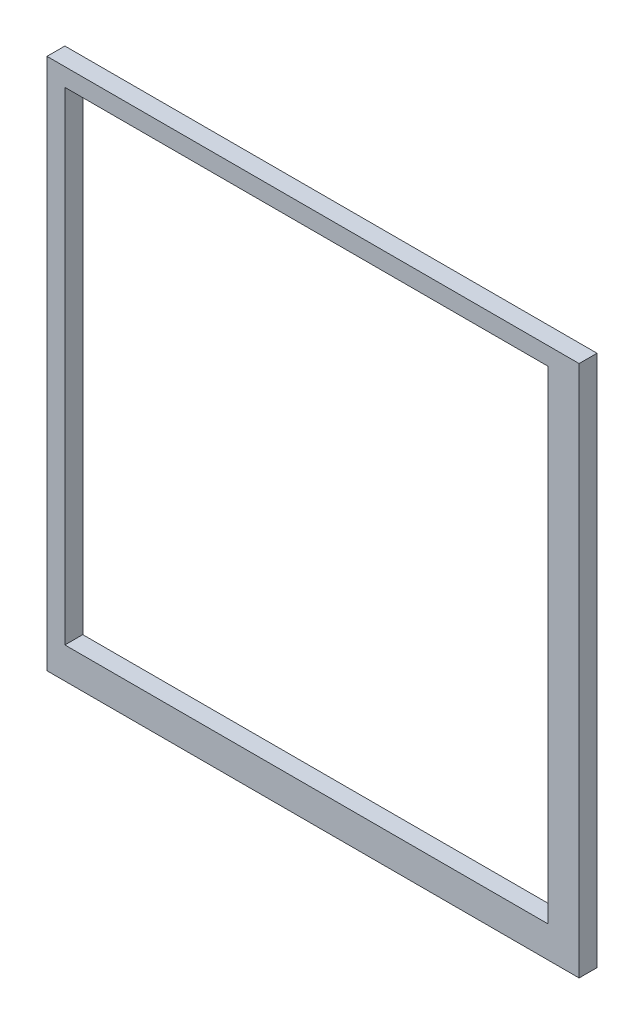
ISO-10303-21;
HEADER;
FILE_DESCRIPTION(('STEP AP214'),'2;1');
FILE_NAME('part.step','',(''),(''),'','','');
FILE_SCHEMA(('AUTOMOTIVE_DESIGN { 1 0 10303 214 1 1 1 1 }'));
ENDSEC;
DATA;
#1=APPLICATION_CONTEXT('core data for automotive mechanical design processes');
#2=APPLICATION_PROTOCOL_DEFINITION('international standard','automotive_design',2000,#1);
#3=PRODUCT_CONTEXT('',#1,'mechanical');
#4=PRODUCT('Part','Part','',(#3));
#5=PRODUCT_RELATED_PRODUCT_CATEGORY('part','',(#4));
#6=PRODUCT_DEFINITION_FORMATION('','',#4);
#7=PRODUCT_DEFINITION_CONTEXT('part definition',#1,'design');
#8=PRODUCT_DEFINITION('design','',#6,#7);
#9=PRODUCT_DEFINITION_SHAPE('','',#8);
#10=(LENGTH_UNIT() NAMED_UNIT(*) SI_UNIT(.MILLI.,.METRE.));
#11=(NAMED_UNIT(*) PLANE_ANGLE_UNIT() SI_UNIT($,.RADIAN.));
#12=(NAMED_UNIT(*) SI_UNIT($,.STERADIAN.) SOLID_ANGLE_UNIT());
#13=UNCERTAINTY_MEASURE_WITH_UNIT(LENGTH_MEASURE(1.E-05),#10,'distance_accuracy_value','');
#14=(GEOMETRIC_REPRESENTATION_CONTEXT(3) GLOBAL_UNCERTAINTY_ASSIGNED_CONTEXT((#13)) GLOBAL_UNIT_ASSIGNED_CONTEXT((#10,
#11,#12)) REPRESENTATION_CONTEXT('',''));
#15=CARTESIAN_POINT('',(0.,0.,0.));
#16=DIRECTION('',(0.,0.,1.));
#17=DIRECTION('',(1.,0.,0.));
#18=AXIS2_PLACEMENT_3D('',#15,#16,#17);
#19=CARTESIAN_POINT('',(0.,0.,20.));
#20=DIRECTION('',(0.,0.,-1.));
#21=DIRECTION('',(-1.,0.,0.));
#22=AXIS2_PLACEMENT_3D('',#19,#20,#21);
#23=PLANE('',#22);
#24=DIRECTION('',(-1.,0.,0.));
#25=VECTOR('',#24,1.);
#26=CARTESIAN_POINT('',(-290.,290.,20.));
#27=LINE('',#26,#25);
#28=CARTESIAN_POINT('',(305.,290.,20.));
#29=VERTEX_POINT('',#28);
#30=CARTESIAN_POINT('',(-290.,290.,20.));
#31=VERTEX_POINT('',#30);
#32=EDGE_CURVE('E135',#29,#31,#27,.T.);
#33=ORIENTED_EDGE('',*,*,#32,.T.);
#34=DIRECTION('',(0.,-1.,0.));
#35=VECTOR('',#34,1.);
#36=CARTESIAN_POINT('',(-290.,290.,20.));
#37=LINE('',#36,#35);
#38=CARTESIAN_POINT('',(-290.,-305.,20.));
#39=VERTEX_POINT('',#38);
#40=EDGE_CURVE('E138',#31,#39,#37,.T.);
#41=ORIENTED_EDGE('',*,*,#40,.T.);
#42=DIRECTION('',(1.,0.,0.));
#43=VECTOR('',#42,1.);
#44=CARTESIAN_POINT('',(-290.,-305.,20.));
#45=LINE('',#44,#43);
#46=CARTESIAN_POINT('',(305.,-305.,20.));
#47=VERTEX_POINT('',#46);
#48=EDGE_CURVE('E141',#39,#47,#45,.T.);
#49=ORIENTED_EDGE('',*,*,#48,.T.);
#50=DIRECTION('',(0.,1.,0.));
#51=VECTOR('',#50,1.);
#52=CARTESIAN_POINT('',(305.,290.,20.));
#53=LINE('',#52,#51);
#54=EDGE_CURVE('E143',#47,#29,#53,.T.);
#55=ORIENTED_EDGE('',*,*,#54,.T.);
#56=EDGE_LOOP('',(#33,#41,#49,#55));
#57=FACE_BOUND('',#56,.T.);
#58=DIRECTION('',(0.,1.,0.));
#59=VECTOR('',#58,1.);
#60=CARTESIAN_POINT('',(270.,270.,20.));
#61=LINE('',#60,#59);
#62=CARTESIAN_POINT('',(270.,-270.,20.));
#63=VERTEX_POINT('',#62);
#64=CARTESIAN_POINT('',(270.,270.,20.));
#65=VERTEX_POINT('',#64);
#66=EDGE_CURVE('E99',#63,#65,#61,.T.);
#67=ORIENTED_EDGE('',*,*,#66,.F.);
#68=DIRECTION('',(1.,0.,0.));
#69=VECTOR('',#68,1.);
#70=CARTESIAN_POINT('',(-270.,-270.,20.));
#71=LINE('',#70,#69);
#72=CARTESIAN_POINT('',(-270.,-270.,20.));
#73=VERTEX_POINT('',#72);
#74=EDGE_CURVE('E121',#73,#63,#71,.T.);
#75=ORIENTED_EDGE('',*,*,#74,.F.);
#76=DIRECTION('',(0.,-1.,0.));
#77=VECTOR('',#76,1.);
#78=CARTESIAN_POINT('',(-270.,270.,20.));
#79=LINE('',#78,#77);
#80=CARTESIAN_POINT('',(-270.,270.,20.));
#81=VERTEX_POINT('',#80);
#82=EDGE_CURVE('E119',#81,#73,#79,.T.);
#83=ORIENTED_EDGE('',*,*,#82,.F.);
#84=DIRECTION('',(-1.,0.,0.));
#85=VECTOR('',#84,1.);
#86=CARTESIAN_POINT('',(-270.,270.,20.));
#87=LINE('',#86,#85);
#88=EDGE_CURVE('E107',#65,#81,#87,.T.);
#89=ORIENTED_EDGE('',*,*,#88,.F.);
#90=EDGE_LOOP('',(#67,#75,#83,#89));
#91=FACE_BOUND('',#90,.T.);
#92=ADVANCED_FACE('F34',(#57,#91),#23,.F.);
#93=CARTESIAN_POINT('',(0.,0.,0.));
#94=DIRECTION('',(0.,0.,-1.));
#95=DIRECTION('',(-1.,0.,0.));
#96=AXIS2_PLACEMENT_3D('',#93,#94,#95);
#97=PLANE('',#96);
#98=DIRECTION('',(-1.,0.,0.));
#99=VECTOR('',#98,1.);
#100=CARTESIAN_POINT('',(-290.,290.,0.));
#101=LINE('',#100,#99);
#102=CARTESIAN_POINT('',(305.,290.,0.));
#103=VERTEX_POINT('',#102);
#104=CARTESIAN_POINT('',(-290.,290.,0.));
#105=VERTEX_POINT('',#104);
#106=EDGE_CURVE('E115',#103,#105,#101,.T.);
#107=ORIENTED_EDGE('',*,*,#106,.F.);
#108=DIRECTION('',(0.,1.,0.));
#109=VECTOR('',#108,1.);
#110=CARTESIAN_POINT('',(305.,290.,0.));
#111=LINE('',#110,#109);
#112=CARTESIAN_POINT('',(305.,-305.,0.));
#113=VERTEX_POINT('',#112);
#114=EDGE_CURVE('E139',#113,#103,#111,.T.);
#115=ORIENTED_EDGE('',*,*,#114,.F.);
#116=DIRECTION('',(1.,0.,0.));
#117=VECTOR('',#116,1.);
#118=CARTESIAN_POINT('',(-290.,-305.,0.));
#119=LINE('',#118,#117);
#120=CARTESIAN_POINT('',(-290.,-305.,0.));
#121=VERTEX_POINT('',#120);
#122=EDGE_CURVE('E150',#121,#113,#119,.T.);
#123=ORIENTED_EDGE('',*,*,#122,.F.);
#124=DIRECTION('',(0.,-1.,0.));
#125=VECTOR('',#124,1.);
#126=CARTESIAN_POINT('',(-290.,290.,0.));
#127=LINE('',#126,#125);
#128=EDGE_CURVE('E148',#105,#121,#127,.T.);
#129=ORIENTED_EDGE('',*,*,#128,.F.);
#130=EDGE_LOOP('',(#107,#115,#123,#129));
#131=FACE_BOUND('',#130,.T.);
#132=DIRECTION('',(1.,0.,0.));
#133=VECTOR('',#132,1.);
#134=CARTESIAN_POINT('',(-270.,-270.,0.));
#135=LINE('',#134,#133);
#136=CARTESIAN_POINT('',(-270.,-270.,0.));
#137=VERTEX_POINT('',#136);
#138=CARTESIAN_POINT('',(270.,-270.,0.));
#139=VERTEX_POINT('',#138);
#140=EDGE_CURVE('E108',#137,#139,#135,.T.);
#141=ORIENTED_EDGE('',*,*,#140,.T.);
#142=DIRECTION('',(0.,1.,0.));
#143=VECTOR('',#142,1.);
#144=CARTESIAN_POINT('',(270.,270.,0.));
#145=LINE('',#144,#143);
#146=CARTESIAN_POINT('',(270.,270.,0.));
#147=VERTEX_POINT('',#146);
#148=EDGE_CURVE('E57',#139,#147,#145,.T.);
#149=ORIENTED_EDGE('',*,*,#148,.T.);
#150=DIRECTION('',(-1.,0.,0.));
#151=VECTOR('',#150,1.);
#152=CARTESIAN_POINT('',(-270.,270.,0.));
#153=LINE('',#152,#151);
#154=CARTESIAN_POINT('',(-270.,270.,0.));
#155=VERTEX_POINT('',#154);
#156=EDGE_CURVE('E114',#147,#155,#153,.T.);
#157=ORIENTED_EDGE('',*,*,#156,.T.);
#158=DIRECTION('',(0.,-1.,0.));
#159=VECTOR('',#158,1.);
#160=CARTESIAN_POINT('',(-270.,270.,0.));
#161=LINE('',#160,#159);
#162=EDGE_CURVE('E127',#155,#137,#161,.T.);
#163=ORIENTED_EDGE('',*,*,#162,.T.);
#164=EDGE_LOOP('',(#141,#149,#157,#163));
#165=FACE_BOUND('',#164,.T.);
#166=ADVANCED_FACE('F168',(#131,#165),#97,.T.);
#167=CARTESIAN_POINT('',(-290.,290.,20.));
#168=DIRECTION('',(0.,-1.,0.));
#169=DIRECTION('',(0.,0.,-1.));
#170=AXIS2_PLACEMENT_3D('',#167,#168,#169);
#171=PLANE('',#170);
#172=ORIENTED_EDGE('',*,*,#106,.T.);
#173=DIRECTION('',(0.,0.,-1.));
#174=VECTOR('',#173,1.);
#175=CARTESIAN_POINT('',(-290.,290.,20.));
#176=LINE('',#175,#174);
#177=EDGE_CURVE('E11',#31,#105,#176,.T.);
#178=ORIENTED_EDGE('',*,*,#177,.F.);
#179=ORIENTED_EDGE('',*,*,#32,.F.);
#180=DIRECTION('',(0.,0.,-1.));
#181=VECTOR('',#180,1.);
#182=CARTESIAN_POINT('',(305.,290.,20.));
#183=LINE('',#182,#181);
#184=EDGE_CURVE('E145',#29,#103,#183,.T.);
#185=ORIENTED_EDGE('',*,*,#184,.T.);
#186=EDGE_LOOP('',(#172,#178,#179,#185));
#187=FACE_BOUND('',#186,.T.);
#188=ADVANCED_FACE('F36',(#187),#171,.F.);
#189=CARTESIAN_POINT('',(-290.,290.,20.));
#190=DIRECTION('',(1.,0.,0.));
#191=DIRECTION('',(0.,1.,0.));
#192=AXIS2_PLACEMENT_3D('',#189,#190,#191);
#193=PLANE('',#192);
#194=ORIENTED_EDGE('',*,*,#128,.T.);
#195=DIRECTION('',(0.,0.,-1.));
#196=VECTOR('',#195,1.);
#197=CARTESIAN_POINT('',(-290.,-305.,20.));
#198=LINE('',#197,#196);
#199=EDGE_CURVE('E42',#39,#121,#198,.T.);
#200=ORIENTED_EDGE('',*,*,#199,.F.);
#201=ORIENTED_EDGE('',*,*,#40,.F.);
#202=ORIENTED_EDGE('',*,*,#177,.T.);
#203=EDGE_LOOP('',(#194,#200,#201,#202));
#204=FACE_BOUND('',#203,.T.);
#205=ADVANCED_FACE('F178',(#204),#193,.F.);
#206=CARTESIAN_POINT('',(-290.,-305.,20.));
#207=DIRECTION('',(0.,1.,0.));
#208=DIRECTION('',(0.,0.,1.));
#209=AXIS2_PLACEMENT_3D('',#206,#207,#208);
#210=PLANE('',#209);
#211=ORIENTED_EDGE('',*,*,#122,.T.);
#212=DIRECTION('',(0.,0.,-1.));
#213=VECTOR('',#212,1.);
#214=CARTESIAN_POINT('',(305.,-305.,20.));
#215=LINE('',#214,#213);
#216=EDGE_CURVE('E155',#47,#113,#215,.T.);
#217=ORIENTED_EDGE('',*,*,#216,.F.);
#218=ORIENTED_EDGE('',*,*,#48,.F.);
#219=ORIENTED_EDGE('',*,*,#199,.T.);
#220=EDGE_LOOP('',(#211,#217,#218,#219));
#221=FACE_BOUND('',#220,.T.);
#222=ADVANCED_FACE('F162',(#221),#210,.F.);
#223=CARTESIAN_POINT('',(305.,290.,20.));
#224=DIRECTION('',(-1.,0.,0.));
#225=DIRECTION('',(0.,-1.,0.));
#226=AXIS2_PLACEMENT_3D('',#223,#224,#225);
#227=PLANE('',#226);
#228=ORIENTED_EDGE('',*,*,#114,.T.);
#229=ORIENTED_EDGE('',*,*,#184,.F.);
#230=ORIENTED_EDGE('',*,*,#54,.F.);
#231=ORIENTED_EDGE('',*,*,#216,.T.);
#232=EDGE_LOOP('',(#228,#229,#230,#231));
#233=FACE_BOUND('',#232,.T.);
#234=ADVANCED_FACE('F172',(#233),#227,.F.);
#235=CARTESIAN_POINT('',(270.,270.,20.));
#236=DIRECTION('',(-1.,0.,0.));
#237=DIRECTION('',(0.,-1.,0.));
#238=AXIS2_PLACEMENT_3D('',#235,#236,#237);
#239=PLANE('',#238);
#240=ORIENTED_EDGE('',*,*,#148,.F.);
#241=DIRECTION('',(0.,0.,-1.));
#242=VECTOR('',#241,1.);
#243=CARTESIAN_POINT('',(270.,-270.,20.));
#244=LINE('',#243,#242);
#245=EDGE_CURVE('E103',#63,#139,#244,.T.);
#246=ORIENTED_EDGE('',*,*,#245,.F.);
#247=ORIENTED_EDGE('',*,*,#66,.T.);
#248=DIRECTION('',(0.,0.,-1.));
#249=VECTOR('',#248,1.);
#250=CARTESIAN_POINT('',(270.,270.,20.));
#251=LINE('',#250,#249);
#252=EDGE_CURVE('E102',#65,#147,#251,.T.);
#253=ORIENTED_EDGE('',*,*,#252,.T.);
#254=EDGE_LOOP('',(#240,#246,#247,#253));
#255=FACE_BOUND('',#254,.T.);
#256=ADVANCED_FACE('F101',(#255),#239,.T.);
#257=CARTESIAN_POINT('',(-270.,270.,20.));
#258=DIRECTION('',(0.,-1.,0.));
#259=DIRECTION('',(0.,0.,-1.));
#260=AXIS2_PLACEMENT_3D('',#257,#258,#259);
#261=PLANE('',#260);
#262=ORIENTED_EDGE('',*,*,#156,.F.);
#263=ORIENTED_EDGE('',*,*,#252,.F.);
#264=ORIENTED_EDGE('',*,*,#88,.T.);
#265=DIRECTION('',(0.,0.,-1.));
#266=VECTOR('',#265,1.);
#267=CARTESIAN_POINT('',(-270.,270.,20.));
#268=LINE('',#267,#266);
#269=EDGE_CURVE('E116',#81,#155,#268,.T.);
#270=ORIENTED_EDGE('',*,*,#269,.T.);
#271=EDGE_LOOP('',(#262,#263,#264,#270));
#272=FACE_BOUND('',#271,.T.);
#273=ADVANCED_FACE('F111',(#272),#261,.T.);
#274=CARTESIAN_POINT('',(-270.,270.,20.));
#275=DIRECTION('',(1.,0.,0.));
#276=DIRECTION('',(0.,1.,0.));
#277=AXIS2_PLACEMENT_3D('',#274,#275,#276);
#278=PLANE('',#277);
#279=ORIENTED_EDGE('',*,*,#162,.F.);
#280=ORIENTED_EDGE('',*,*,#269,.F.);
#281=ORIENTED_EDGE('',*,*,#82,.T.);
#282=DIRECTION('',(0.,0.,-1.));
#283=VECTOR('',#282,1.);
#284=CARTESIAN_POINT('',(-270.,-270.,20.));
#285=LINE('',#284,#283);
#286=EDGE_CURVE('E49',#73,#137,#285,.T.);
#287=ORIENTED_EDGE('',*,*,#286,.T.);
#288=EDGE_LOOP('',(#279,#280,#281,#287));
#289=FACE_BOUND('',#288,.T.);
#290=ADVANCED_FACE('F201',(#289),#278,.T.);
#291=CARTESIAN_POINT('',(-270.,-270.,20.));
#292=DIRECTION('',(0.,1.,0.));
#293=DIRECTION('',(0.,0.,1.));
#294=AXIS2_PLACEMENT_3D('',#291,#292,#293);
#295=PLANE('',#294);
#296=ORIENTED_EDGE('',*,*,#140,.F.);
#297=ORIENTED_EDGE('',*,*,#286,.F.);
#298=ORIENTED_EDGE('',*,*,#74,.T.);
#299=ORIENTED_EDGE('',*,*,#245,.T.);
#300=EDGE_LOOP('',(#296,#297,#298,#299));
#301=FACE_BOUND('',#300,.T.);
#302=ADVANCED_FACE('F205',(#301),#295,.T.);
#303=CLOSED_SHELL('',(#92,#166,#188,#205,#222,#234,#256,#273,#290,#302));
#304=MANIFOLD_SOLID_BREP('B2',#303);
#305=ADVANCED_BREP_SHAPE_REPRESENTATION('',(#18,#304),#14);
#306=SHAPE_DEFINITION_REPRESENTATION(#9,#305);
ENDSEC;
END-ISO-10303-21;
